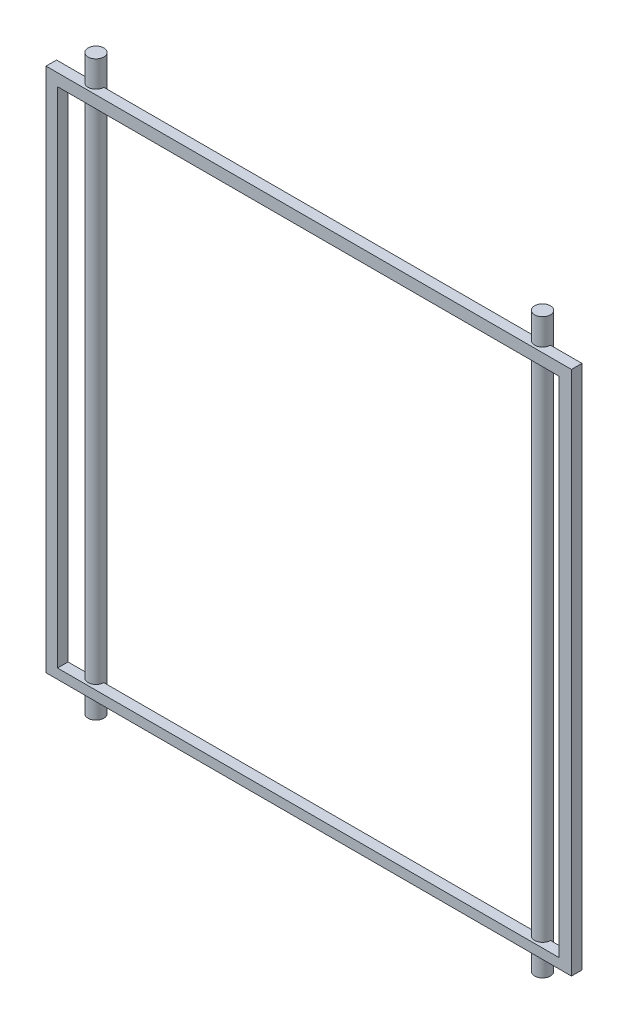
ISO-10303-21;
HEADER;
FILE_DESCRIPTION(('STEP AP214'),'2;1');
FILE_NAME('part.step','',(''),(''),'','','');
FILE_SCHEMA(('AUTOMOTIVE_DESIGN { 1 0 10303 214 1 1 1 1 }'));
ENDSEC;
DATA;
#1=APPLICATION_CONTEXT('core data for automotive mechanical design processes');
#2=APPLICATION_PROTOCOL_DEFINITION('international standard','automotive_design',2000,#1);
#3=PRODUCT_CONTEXT('',#1,'mechanical');
#4=PRODUCT('Part','Part','',(#3));
#5=PRODUCT_RELATED_PRODUCT_CATEGORY('part','',(#4));
#6=PRODUCT_DEFINITION_FORMATION('','',#4);
#7=PRODUCT_DEFINITION_CONTEXT('part definition',#1,'design');
#8=PRODUCT_DEFINITION('design','',#6,#7);
#9=PRODUCT_DEFINITION_SHAPE('','',#8);
#10=(LENGTH_UNIT() NAMED_UNIT(*) SI_UNIT(.MILLI.,.METRE.));
#11=(NAMED_UNIT(*) PLANE_ANGLE_UNIT() SI_UNIT($,.RADIAN.));
#12=(NAMED_UNIT(*) SI_UNIT($,.STERADIAN.) SOLID_ANGLE_UNIT());
#13=UNCERTAINTY_MEASURE_WITH_UNIT(LENGTH_MEASURE(1.E-05),#10,'distance_accuracy_value','');
#14=(GEOMETRIC_REPRESENTATION_CONTEXT(3) GLOBAL_UNCERTAINTY_ASSIGNED_CONTEXT((#13)) GLOBAL_UNIT_ASSIGNED_CONTEXT((#10,
#11,#12)) REPRESENTATION_CONTEXT('',''));
#15=CARTESIAN_POINT('',(0.,0.,0.));
#16=DIRECTION('',(0.,0.,1.));
#17=DIRECTION('',(1.,0.,0.));
#18=AXIS2_PLACEMENT_3D('',#15,#16,#17);
#19=CARTESIAN_POINT('',(-74.9999999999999,-80.,0.));
#20=DIRECTION('',(0.,0.,1.));
#21=DIRECTION('',(1.,0.,0.));
#22=AXIS2_PLACEMENT_3D('',#19,#20,#21);
#23=PLANE('',#22);
#24=DIRECTION('',(0.,-1.,0.));
#25=VECTOR('',#24,1.);
#26=CARTESIAN_POINT('',(-15.,970.000000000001,0.));
#27=LINE('',#26,#25);
#28=CARTESIAN_POINT('',(-15.,-80.0000000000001,0.));
#29=VERTEX_POINT('',#28);
#30=CARTESIAN_POINT('',(-15.,-61.2429061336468,0.));
#31=VERTEX_POINT('',#30);
#32=EDGE_CURVE('E47',#29,#31,#27,.F.);
#33=ORIENTED_EDGE('',*,*,#32,.F.);
#34=DIRECTION('',(1.,0.,0.));
#35=VECTOR('',#34,1.);
#36=CARTESIAN_POINT('',(-74.9999999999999,-80.,0.));
#37=LINE('',#36,#35);
#38=CARTESIAN_POINT('',(-74.9999999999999,-80.,0.));
#39=VERTEX_POINT('',#38);
#40=EDGE_CURVE('E243',#39,#29,#37,.T.);
#41=ORIENTED_EDGE('',*,*,#40,.F.);
#42=DIRECTION('',(0.,-1.,0.));
#43=VECTOR('',#42,1.);
#44=CARTESIAN_POINT('',(-75.,920.,0.));
#45=LINE('',#44,#43);
#46=CARTESIAN_POINT('',(-75.,920.,0.));
#47=VERTEX_POINT('',#46);
#48=EDGE_CURVE('E248',#47,#39,#45,.T.);
#49=ORIENTED_EDGE('',*,*,#48,.F.);
#50=DIRECTION('',(-1.,0.,0.));
#51=VECTOR('',#50,1.);
#52=CARTESIAN_POINT('',(-75.,920.,0.));
#53=LINE('',#52,#51);
#54=CARTESIAN_POINT('',(-15.,920.,0.));
#55=VERTEX_POINT('',#54);
#56=EDGE_CURVE('E156',#55,#47,#53,.T.);
#57=ORIENTED_EDGE('',*,*,#56,.F.);
#58=CARTESIAN_POINT('',(-15.,897.016941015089,0.));
#59=VERTEX_POINT('',#58);
#60=EDGE_CURVE('E144',#59,#55,#27,.F.);
#61=ORIENTED_EDGE('',*,*,#60,.F.);
#62=DIRECTION('',(-1.,0.,0.));
#63=VECTOR('',#62,1.);
#64=CARTESIAN_POINT('',(-53.1629825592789,897.016941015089,0.));
#65=LINE('',#64,#63);
#66=CARTESIAN_POINT('',(-53.1629825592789,897.016941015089,0.));
#67=VERTEX_POINT('',#66);
#68=EDGE_CURVE('E153',#59,#67,#65,.T.);
#69=ORIENTED_EDGE('',*,*,#68,.T.);
#70=DIRECTION('',(0.,-1.,0.));
#71=VECTOR('',#70,1.);
#72=CARTESIAN_POINT('',(-53.1629825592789,897.016941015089,0.));
#73=LINE('',#72,#71);
#74=CARTESIAN_POINT('',(-53.1629825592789,-61.2429061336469,0.));
#75=VERTEX_POINT('',#74);
#76=EDGE_CURVE('E192',#67,#75,#73,.T.);
#77=ORIENTED_EDGE('',*,*,#76,.T.);
#78=DIRECTION('',(1.,0.,0.));
#79=VECTOR('',#78,1.);
#80=CARTESIAN_POINT('',(-53.1629825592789,-61.2429061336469,0.));
#81=LINE('',#80,#79);
#82=EDGE_CURVE('E168',#75,#31,#81,.T.);
#83=ORIENTED_EDGE('',*,*,#82,.T.);
#84=EDGE_LOOP('',(#33,#41,#49,#57,#61,#69,#77,#83));
#85=FACE_BOUND('',#84,.T.);
#86=ADVANCED_FACE('F32',(#85),#23,.F.);
#87=DIRECTION('',(0.,-1.,0.));
#88=VECTOR('',#87,1.);
#89=CARTESIAN_POINT('',(15.,970.000000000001,0.));
#90=LINE('',#89,#88);
#91=CARTESIAN_POINT('',(15.,920.,0.));
#92=VERTEX_POINT('',#91);
#93=CARTESIAN_POINT('',(15.,897.016941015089,0.));
#94=VERTEX_POINT('',#93);
#95=EDGE_CURVE('E55',#92,#94,#90,.T.);
#96=ORIENTED_EDGE('',*,*,#95,.F.);
#97=CARTESIAN_POINT('',(834.999999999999,920.,0.));
#98=VERTEX_POINT('',#97);
#99=EDGE_CURVE('E240',#98,#92,#53,.T.);
#100=ORIENTED_EDGE('',*,*,#99,.F.);
#101=DIRECTION('',(0.,-1.,0.));
#102=VECTOR('',#101,1.);
#103=CARTESIAN_POINT('',(834.999999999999,970.000000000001,0.));
#104=LINE('',#103,#102);
#105=CARTESIAN_POINT('',(834.999999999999,897.016941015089,0.));
#106=VERTEX_POINT('',#105);
#107=EDGE_CURVE('E331',#106,#98,#104,.F.);
#108=ORIENTED_EDGE('',*,*,#107,.F.);
#109=EDGE_CURVE('E163',#106,#94,#65,.T.);
#110=ORIENTED_EDGE('',*,*,#109,.T.);
#111=EDGE_LOOP('',(#96,#100,#108,#110));
#112=FACE_BOUND('',#111,.T.);
#113=ADVANCED_FACE('F274',(#112),#23,.F.);
#114=CARTESIAN_POINT('',(15.,-61.2429061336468,0.));
#115=VERTEX_POINT('',#114);
#116=CARTESIAN_POINT('',(15.,-80.0000000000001,0.));
#117=VERTEX_POINT('',#116);
#118=EDGE_CURVE('E302',#115,#117,#90,.T.);
#119=ORIENTED_EDGE('',*,*,#118,.F.);
#120=CARTESIAN_POINT('',(834.999999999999,-61.2429061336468,0.));
#121=VERTEX_POINT('',#120);
#122=EDGE_CURVE('E196',#115,#121,#81,.T.);
#123=ORIENTED_EDGE('',*,*,#122,.T.);
#124=CARTESIAN_POINT('',(834.999999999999,-80.0000000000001,0.));
#125=VERTEX_POINT('',#124);
#126=EDGE_CURVE('E304',#125,#121,#104,.F.);
#127=ORIENTED_EDGE('',*,*,#126,.F.);
#128=EDGE_CURVE('E246',#117,#125,#37,.T.);
#129=ORIENTED_EDGE('',*,*,#128,.F.);
#130=EDGE_LOOP('',(#119,#123,#127,#129));
#131=FACE_BOUND('',#130,.T.);
#132=ADVANCED_FACE('F271',(#131),#23,.F.);
#133=CARTESIAN_POINT('',(-74.9999999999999,-80.,20.));
#134=DIRECTION('',(0.,1.,0.));
#135=DIRECTION('',(0.,0.,1.));
#136=AXIS2_PLACEMENT_3D('',#133,#134,#135);
#137=PLANE('',#136);
#138=CARTESIAN_POINT('',(0.,-80.0000000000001,0.));
#139=DIRECTION('',(0.,1.,0.));
#140=DIRECTION('',(0.,0.,1.));
#141=AXIS2_PLACEMENT_3D('',#138,#139,#140);
#142=CIRCLE('',#141,15.);
#143=EDGE_CURVE('E294',#117,#29,#142,.F.);
#144=ORIENTED_EDGE('',*,*,#143,.F.);
#145=ORIENTED_EDGE('',*,*,#128,.T.);
#146=CARTESIAN_POINT('',(850.,-80.0000000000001,0.));
#147=DIRECTION('',(0.,1.,0.));
#148=DIRECTION('',(0.,0.,1.));
#149=AXIS2_PLACEMENT_3D('',#146,#147,#148);
#150=CIRCLE('',#149,15.0000000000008);
#151=CARTESIAN_POINT('',(865.000000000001,-80.0000000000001,0.));
#152=VERTEX_POINT('',#151);
#153=EDGE_CURVE('E185',#152,#125,#150,.F.);
#154=ORIENTED_EDGE('',*,*,#153,.F.);
#155=CARTESIAN_POINT('',(925.,-80.,0.));
#156=VERTEX_POINT('',#155);
#157=EDGE_CURVE('E247',#152,#156,#37,.T.);
#158=ORIENTED_EDGE('',*,*,#157,.T.);
#159=DIRECTION('',(0.,0.,-1.));
#160=VECTOR('',#159,1.);
#161=CARTESIAN_POINT('',(925.,-80.,20.));
#162=LINE('',#161,#160);
#163=CARTESIAN_POINT('',(925.,-80.,20.));
#164=VERTEX_POINT('',#163);
#165=EDGE_CURVE('E224',#164,#156,#162,.T.);
#166=ORIENTED_EDGE('',*,*,#165,.F.);
#167=DIRECTION('',(1.,0.,0.));
#168=VECTOR('',#167,1.);
#169=CARTESIAN_POINT('',(-74.9999999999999,-80.,20.));
#170=LINE('',#169,#168);
#171=CARTESIAN_POINT('',(-74.9999999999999,-80.,20.));
#172=VERTEX_POINT('',#171);
#173=EDGE_CURVE('E254',#172,#164,#170,.T.);
#174=ORIENTED_EDGE('',*,*,#173,.F.);
#175=DIRECTION('',(0.,0.,-1.));
#176=VECTOR('',#175,1.);
#177=CARTESIAN_POINT('',(-74.9999999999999,-80.,20.));
#178=LINE('',#177,#176);
#179=EDGE_CURVE('E222',#172,#39,#178,.T.);
#180=ORIENTED_EDGE('',*,*,#179,.T.);
#181=ORIENTED_EDGE('',*,*,#40,.T.);
#182=EDGE_LOOP('',(#144,#145,#154,#158,#166,#174,#180,#181));
#183=FACE_BOUND('',#182,.T.);
#184=ADVANCED_FACE('F283',(#183),#137,.F.);
#185=CARTESIAN_POINT('',(-75.,920.,20.));
#186=DIRECTION('',(0.,-1.,0.));
#187=DIRECTION('',(0.,0.,-1.));
#188=AXIS2_PLACEMENT_3D('',#185,#186,#187);
#189=PLANE('',#188);
#190=CARTESIAN_POINT('',(0.,920.,0.));
#191=DIRECTION('',(0.,-1.,0.));
#192=DIRECTION('',(0.,0.,-1.));
#193=AXIS2_PLACEMENT_3D('',#190,#191,#192);
#194=CIRCLE('',#193,15.);
#195=EDGE_CURVE('E157',#55,#92,#194,.F.);
#196=ORIENTED_EDGE('',*,*,#195,.F.);
#197=ORIENTED_EDGE('',*,*,#56,.T.);
#198=DIRECTION('',(0.,0.,-1.));
#199=VECTOR('',#198,1.);
#200=CARTESIAN_POINT('',(-75.,920.,20.));
#201=LINE('',#200,#199);
#202=CARTESIAN_POINT('',(-75.,920.,20.));
#203=VERTEX_POINT('',#202);
#204=EDGE_CURVE('E232',#203,#47,#201,.T.);
#205=ORIENTED_EDGE('',*,*,#204,.F.);
#206=DIRECTION('',(-1.,0.,0.));
#207=VECTOR('',#206,1.);
#208=CARTESIAN_POINT('',(-75.,920.,20.));
#209=LINE('',#208,#207);
#210=CARTESIAN_POINT('',(925.,920.,20.));
#211=VERTEX_POINT('',#210);
#212=EDGE_CURVE('E235',#211,#203,#209,.T.);
#213=ORIENTED_EDGE('',*,*,#212,.F.);
#214=DIRECTION('',(0.,0.,-1.));
#215=VECTOR('',#214,1.);
#216=CARTESIAN_POINT('',(925.,920.,20.));
#217=LINE('',#216,#215);
#218=CARTESIAN_POINT('',(925.,920.,0.));
#219=VERTEX_POINT('',#218);
#220=EDGE_CURVE('E229',#211,#219,#217,.T.);
#221=ORIENTED_EDGE('',*,*,#220,.T.);
#222=CARTESIAN_POINT('',(865.000000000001,920.,0.));
#223=VERTEX_POINT('',#222);
#224=EDGE_CURVE('E236',#219,#223,#53,.T.);
#225=ORIENTED_EDGE('',*,*,#224,.T.);
#226=CARTESIAN_POINT('',(850.,920.,0.));
#227=DIRECTION('',(0.,-1.,0.));
#228=DIRECTION('',(0.,0.,-1.));
#229=AXIS2_PLACEMENT_3D('',#226,#227,#228);
#230=CIRCLE('',#229,15.0000000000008);
#231=EDGE_CURVE('E313',#98,#223,#230,.F.);
#232=ORIENTED_EDGE('',*,*,#231,.F.);
#233=ORIENTED_EDGE('',*,*,#99,.T.);
#234=EDGE_LOOP('',(#196,#197,#205,#213,#221,#225,#232,#233));
#235=FACE_BOUND('',#234,.T.);
#236=ADVANCED_FACE('F280',(#235),#189,.F.);
#237=CARTESIAN_POINT('',(-53.1629825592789,-61.2429061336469,20.));
#238=DIRECTION('',(0.,1.,0.));
#239=DIRECTION('',(0.,0.,1.));
#240=AXIS2_PLACEMENT_3D('',#237,#238,#239);
#241=PLANE('',#240);
#242=ORIENTED_EDGE('',*,*,#122,.F.);
#243=CARTESIAN_POINT('',(0.,-61.2429061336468,0.));
#244=DIRECTION('',(0.,1.,0.));
#245=DIRECTION('',(0.,0.,1.));
#246=AXIS2_PLACEMENT_3D('',#243,#244,#245);
#247=CIRCLE('',#246,15.);
#248=EDGE_CURVE('E319',#115,#31,#247,.F.);
#249=ORIENTED_EDGE('',*,*,#248,.T.);
#250=ORIENTED_EDGE('',*,*,#82,.F.);
#251=DIRECTION('',(0.,0.,-1.));
#252=VECTOR('',#251,1.);
#253=CARTESIAN_POINT('',(-53.1629825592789,-61.2429061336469,20.));
#254=LINE('',#253,#252);
#255=CARTESIAN_POINT('',(-53.1629825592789,-61.2429061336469,20.));
#256=VERTEX_POINT('',#255);
#257=EDGE_CURVE('E213',#256,#75,#254,.T.);
#258=ORIENTED_EDGE('',*,*,#257,.F.);
#259=DIRECTION('',(1.,0.,0.));
#260=VECTOR('',#259,1.);
#261=CARTESIAN_POINT('',(-53.1629825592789,-61.2429061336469,20.));
#262=LINE('',#261,#260);
#263=CARTESIAN_POINT('',(901.177601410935,-61.2429061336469,20.));
#264=VERTEX_POINT('',#263);
#265=EDGE_CURVE('E176',#256,#264,#262,.T.);
#266=ORIENTED_EDGE('',*,*,#265,.T.);
#267=DIRECTION('',(0.,0.,-1.));
#268=VECTOR('',#267,1.);
#269=CARTESIAN_POINT('',(901.177601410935,-61.2429061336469,20.));
#270=LINE('',#269,#268);
#271=CARTESIAN_POINT('',(901.177601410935,-61.2429061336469,0.));
#272=VERTEX_POINT('',#271);
#273=EDGE_CURVE('E207',#264,#272,#270,.T.);
#274=ORIENTED_EDGE('',*,*,#273,.T.);
#275=CARTESIAN_POINT('',(865.000000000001,-61.2429061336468,0.));
#276=VERTEX_POINT('',#275);
#277=EDGE_CURVE('E194',#276,#272,#81,.T.);
#278=ORIENTED_EDGE('',*,*,#277,.F.);
#279=CARTESIAN_POINT('',(850.,-61.2429061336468,0.));
#280=DIRECTION('',(0.,1.,0.));
#281=DIRECTION('',(0.,0.,1.));
#282=AXIS2_PLACEMENT_3D('',#279,#280,#281);
#283=CIRCLE('',#282,15.0000000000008);
#284=EDGE_CURVE('E333',#276,#121,#283,.F.);
#285=ORIENTED_EDGE('',*,*,#284,.T.);
#286=EDGE_LOOP('',(#242,#249,#250,#258,#266,#274,#278,#285));
#287=FACE_BOUND('',#286,.T.);
#288=ADVANCED_FACE('F209',(#287),#241,.T.);
#289=CARTESIAN_POINT('',(-53.1629825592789,897.016941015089,20.));
#290=DIRECTION('',(0.,-1.,0.));
#291=DIRECTION('',(0.,0.,-1.));
#292=AXIS2_PLACEMENT_3D('',#289,#290,#291);
#293=PLANE('',#292);
#294=ORIENTED_EDGE('',*,*,#68,.F.);
#295=CARTESIAN_POINT('',(0.,897.016941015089,0.));
#296=DIRECTION('',(0.,-1.,0.));
#297=DIRECTION('',(0.,0.,-1.));
#298=AXIS2_PLACEMENT_3D('',#295,#296,#297);
#299=CIRCLE('',#298,15.);
#300=EDGE_CURVE('E11',#59,#94,#299,.F.);
#301=ORIENTED_EDGE('',*,*,#300,.T.);
#302=ORIENTED_EDGE('',*,*,#109,.F.);
#303=CARTESIAN_POINT('',(850.,897.016941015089,0.));
#304=DIRECTION('',(0.,-1.,0.));
#305=DIRECTION('',(0.,0.,-1.));
#306=AXIS2_PLACEMENT_3D('',#303,#304,#305);
#307=CIRCLE('',#306,15.0000000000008);
#308=CARTESIAN_POINT('',(865.000000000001,897.016941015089,0.));
#309=VERTEX_POINT('',#308);
#310=EDGE_CURVE('E40',#106,#309,#307,.F.);
#311=ORIENTED_EDGE('',*,*,#310,.T.);
#312=CARTESIAN_POINT('',(901.177601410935,897.016941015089,0.));
#313=VERTEX_POINT('',#312);
#314=EDGE_CURVE('E166',#313,#309,#65,.T.);
#315=ORIENTED_EDGE('',*,*,#314,.F.);
#316=DIRECTION('',(0.,0.,-1.));
#317=VECTOR('',#316,1.);
#318=CARTESIAN_POINT('',(901.177601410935,897.016941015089,20.));
#319=LINE('',#318,#317);
#320=CARTESIAN_POINT('',(901.177601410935,897.016941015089,20.));
#321=VERTEX_POINT('',#320);
#322=EDGE_CURVE('E214',#321,#313,#319,.T.);
#323=ORIENTED_EDGE('',*,*,#322,.F.);
#324=DIRECTION('',(-1.,0.,0.));
#325=VECTOR('',#324,1.);
#326=CARTESIAN_POINT('',(-53.1629825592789,897.016941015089,20.));
#327=LINE('',#326,#325);
#328=CARTESIAN_POINT('',(-53.1629825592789,897.016941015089,20.));
#329=VERTEX_POINT('',#328);
#330=EDGE_CURVE('E190',#321,#329,#327,.T.);
#331=ORIENTED_EDGE('',*,*,#330,.T.);
#332=DIRECTION('',(0.,0.,-1.));
#333=VECTOR('',#332,1.);
#334=CARTESIAN_POINT('',(-53.1629825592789,897.016941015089,20.));
#335=LINE('',#334,#333);
#336=EDGE_CURVE('E162',#329,#67,#335,.T.);
#337=ORIENTED_EDGE('',*,*,#336,.T.);
#338=EDGE_LOOP('',(#294,#301,#302,#311,#315,#323,#331,#337));
#339=FACE_BOUND('',#338,.T.);
#340=ADVANCED_FACE('F160',(#339),#293,.T.);
#341=DIRECTION('',(0.,-1.,0.));
#342=VECTOR('',#341,1.);
#343=CARTESIAN_POINT('',(865.000000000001,970.000000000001,0.));
#344=LINE('',#343,#342);
#345=EDGE_CURVE('E310',#223,#309,#344,.T.);
#346=ORIENTED_EDGE('',*,*,#345,.F.);
#347=ORIENTED_EDGE('',*,*,#224,.F.);
#348=DIRECTION('',(0.,1.,0.));
#349=VECTOR('',#348,1.);
#350=CARTESIAN_POINT('',(925.,920.,0.));
#351=LINE('',#350,#349);
#352=EDGE_CURVE('E241',#156,#219,#351,.T.);
#353=ORIENTED_EDGE('',*,*,#352,.F.);
#354=ORIENTED_EDGE('',*,*,#157,.F.);
#355=EDGE_CURVE('E203',#276,#152,#344,.T.);
#356=ORIENTED_EDGE('',*,*,#355,.F.);
#357=ORIENTED_EDGE('',*,*,#277,.T.);
#358=DIRECTION('',(0.,1.,0.));
#359=VECTOR('',#358,1.);
#360=CARTESIAN_POINT('',(901.177601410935,897.016941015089,0.));
#361=LINE('',#360,#359);
#362=EDGE_CURVE('E164',#272,#313,#361,.T.);
#363=ORIENTED_EDGE('',*,*,#362,.T.);
#364=ORIENTED_EDGE('',*,*,#314,.T.);
#365=EDGE_LOOP('',(#346,#347,#353,#354,#356,#357,#363,#364));
#366=FACE_BOUND('',#365,.T.);
#367=ADVANCED_FACE('F200',(#366),#23,.F.);
#368=CARTESIAN_POINT('',(-74.9999999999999,-80.,20.));
#369=DIRECTION('',(0.,0.,1.));
#370=DIRECTION('',(1.,0.,0.));
#371=AXIS2_PLACEMENT_3D('',#368,#369,#370);
#372=PLANE('',#371);
#373=DIRECTION('',(0.,-1.,0.));
#374=VECTOR('',#373,1.);
#375=CARTESIAN_POINT('',(-75.,920.,20.));
#376=LINE('',#375,#374);
#377=EDGE_CURVE('E239',#203,#172,#376,.T.);
#378=ORIENTED_EDGE('',*,*,#377,.T.);
#379=ORIENTED_EDGE('',*,*,#173,.T.);
#380=DIRECTION('',(0.,1.,0.));
#381=VECTOR('',#380,1.);
#382=CARTESIAN_POINT('',(925.,920.,20.));
#383=LINE('',#382,#381);
#384=EDGE_CURVE('E252',#164,#211,#383,.T.);
#385=ORIENTED_EDGE('',*,*,#384,.T.);
#386=ORIENTED_EDGE('',*,*,#212,.T.);
#387=EDGE_LOOP('',(#378,#379,#385,#386));
#388=FACE_BOUND('',#387,.T.);
#389=ORIENTED_EDGE('',*,*,#265,.F.);
#390=DIRECTION('',(0.,-1.,0.));
#391=VECTOR('',#390,1.);
#392=CARTESIAN_POINT('',(-53.1629825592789,897.016941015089,20.));
#393=LINE('',#392,#391);
#394=EDGE_CURVE('E172',#329,#256,#393,.T.);
#395=ORIENTED_EDGE('',*,*,#394,.F.);
#396=ORIENTED_EDGE('',*,*,#330,.F.);
#397=DIRECTION('',(0.,1.,0.));
#398=VECTOR('',#397,1.);
#399=CARTESIAN_POINT('',(901.177601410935,897.016941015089,20.));
#400=LINE('',#399,#398);
#401=EDGE_CURVE('E182',#264,#321,#400,.T.);
#402=ORIENTED_EDGE('',*,*,#401,.F.);
#403=EDGE_LOOP('',(#389,#395,#396,#402));
#404=FACE_BOUND('',#403,.T.);
#405=ADVANCED_FACE('F260',(#388,#404),#372,.T.);
#406=CARTESIAN_POINT('',(-75.,920.,20.));
#407=DIRECTION('',(1.,0.,0.));
#408=DIRECTION('',(0.,1.,0.));
#409=AXIS2_PLACEMENT_3D('',#406,#407,#408);
#410=PLANE('',#409);
#411=ORIENTED_EDGE('',*,*,#48,.T.);
#412=ORIENTED_EDGE('',*,*,#179,.F.);
#413=ORIENTED_EDGE('',*,*,#377,.F.);
#414=ORIENTED_EDGE('',*,*,#204,.T.);
#415=EDGE_LOOP('',(#411,#412,#413,#414));
#416=FACE_BOUND('',#415,.T.);
#417=ADVANCED_FACE('F34',(#416),#410,.F.);
#418=CARTESIAN_POINT('',(925.,920.,20.));
#419=DIRECTION('',(-1.,0.,0.));
#420=DIRECTION('',(0.,0.,1.));
#421=AXIS2_PLACEMENT_3D('',#418,#419,#420);
#422=PLANE('',#421);
#423=ORIENTED_EDGE('',*,*,#352,.T.);
#424=ORIENTED_EDGE('',*,*,#220,.F.);
#425=ORIENTED_EDGE('',*,*,#384,.F.);
#426=ORIENTED_EDGE('',*,*,#165,.T.);
#427=EDGE_LOOP('',(#423,#424,#425,#426));
#428=FACE_BOUND('',#427,.T.);
#429=ADVANCED_FACE('F268',(#428),#422,.F.);
#430=CARTESIAN_POINT('',(-53.1629825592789,897.016941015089,20.));
#431=DIRECTION('',(1.,0.,0.));
#432=DIRECTION('',(0.,0.,-1.));
#433=AXIS2_PLACEMENT_3D('',#430,#431,#432);
#434=PLANE('',#433);
#435=ORIENTED_EDGE('',*,*,#76,.F.);
#436=ORIENTED_EDGE('',*,*,#336,.F.);
#437=ORIENTED_EDGE('',*,*,#394,.T.);
#438=ORIENTED_EDGE('',*,*,#257,.T.);
#439=EDGE_LOOP('',(#435,#436,#437,#438));
#440=FACE_BOUND('',#439,.T.);
#441=ADVANCED_FACE('F258',(#440),#434,.T.);
#442=CARTESIAN_POINT('',(901.177601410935,897.016941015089,20.));
#443=DIRECTION('',(-1.,0.,0.));
#444=DIRECTION('',(0.,0.,1.));
#445=AXIS2_PLACEMENT_3D('',#442,#443,#444);
#446=PLANE('',#445);
#447=ORIENTED_EDGE('',*,*,#362,.F.);
#448=ORIENTED_EDGE('',*,*,#273,.F.);
#449=ORIENTED_EDGE('',*,*,#401,.T.);
#450=ORIENTED_EDGE('',*,*,#322,.T.);
#451=EDGE_LOOP('',(#447,#448,#449,#450));
#452=FACE_BOUND('',#451,.T.);
#453=ADVANCED_FACE('F216',(#452),#446,.T.);
#454=CARTESIAN_POINT('',(850.,970.000000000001,0.));
#455=DIRECTION('',(0.,-1.,0.));
#456=DIRECTION('',(0.,0.,-1.));
#457=AXIS2_PLACEMENT_3D('',#454,#455,#456);
#458=CYLINDRICAL_SURFACE('',#457,15.0000000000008);
#459=ORIENTED_EDGE('',*,*,#107,.T.);
#460=ORIENTED_EDGE('',*,*,#231,.T.);
#461=ORIENTED_EDGE('',*,*,#345,.T.);
#462=ORIENTED_EDGE('',*,*,#310,.F.);
#463=EDGE_LOOP('',(#459,#460,#461,#462));
#464=FACE_BOUND('',#463,.T.);
#465=CARTESIAN_POINT('',(850.,970.000000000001,0.));
#466=DIRECTION('',(0.,1.,0.));
#467=DIRECTION('',(0.,0.,1.));
#468=AXIS2_PLACEMENT_3D('',#465,#466,#467);
#469=CIRCLE('',#468,15.0000000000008);
#470=CARTESIAN_POINT('',(850.,970.000000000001,15.0000000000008));
#471=VERTEX_POINT('',#470);
#472=EDGE_CURVE('E327',#471,#471,#469,.T.);
#473=ORIENTED_EDGE('',*,*,#472,.F.);
#474=EDGE_LOOP('',(#473));
#475=FACE_BOUND('',#474,.T.);
#476=CARTESIAN_POINT('',(850.,-120.,0.));
#477=DIRECTION('',(0.,1.,0.));
#478=DIRECTION('',(0.,0.,1.));
#479=AXIS2_PLACEMENT_3D('',#476,#477,#478);
#480=CIRCLE('',#479,15.0000000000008);
#481=CARTESIAN_POINT('',(850.,-120.,15.0000000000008));
#482=VERTEX_POINT('',#481);
#483=EDGE_CURVE('E298',#482,#482,#480,.T.);
#484=ORIENTED_EDGE('',*,*,#483,.T.);
#485=EDGE_LOOP('',(#484));
#486=FACE_BOUND('',#485,.T.);
#487=ORIENTED_EDGE('',*,*,#355,.T.);
#488=ORIENTED_EDGE('',*,*,#153,.T.);
#489=ORIENTED_EDGE('',*,*,#126,.T.);
#490=ORIENTED_EDGE('',*,*,#284,.F.);
#491=EDGE_LOOP('',(#487,#488,#489,#490));
#492=FACE_BOUND('',#491,.T.);
#493=ADVANCED_FACE('F335',(#464,#475,#486,#492),#458,.T.);
#494=CARTESIAN_POINT('',(850.,970.000000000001,0.));
#495=DIRECTION('',(0.,1.,0.));
#496=DIRECTION('',(0.,0.,1.));
#497=AXIS2_PLACEMENT_3D('',#494,#495,#496);
#498=PLANE('',#497);
#499=ORIENTED_EDGE('',*,*,#472,.T.);
#500=EDGE_LOOP('',(#499));
#501=FACE_BOUND('',#500,.T.);
#502=ADVANCED_FACE('F337',(#501),#498,.T.);
#503=CARTESIAN_POINT('',(850.,-120.,0.));
#504=DIRECTION('',(0.,1.,0.));
#505=DIRECTION('',(0.,0.,1.));
#506=AXIS2_PLACEMENT_3D('',#503,#504,#505);
#507=PLANE('',#506);
#508=ORIENTED_EDGE('',*,*,#483,.F.);
#509=EDGE_LOOP('',(#508));
#510=FACE_BOUND('',#509,.T.);
#511=ADVANCED_FACE('F343',(#510),#507,.F.);
#512=CARTESIAN_POINT('',(0.,970.000000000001,0.));
#513=DIRECTION('',(0.,-1.,0.));
#514=DIRECTION('',(0.,0.,-1.));
#515=AXIS2_PLACEMENT_3D('',#512,#513,#514);
#516=CYLINDRICAL_SURFACE('',#515,15.);
#517=ORIENTED_EDGE('',*,*,#60,.T.);
#518=ORIENTED_EDGE('',*,*,#195,.T.);
#519=ORIENTED_EDGE('',*,*,#95,.T.);
#520=ORIENTED_EDGE('',*,*,#300,.F.);
#521=EDGE_LOOP('',(#517,#518,#519,#520));
#522=FACE_BOUND('',#521,.T.);
#523=CARTESIAN_POINT('',(0.,970.000000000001,0.));
#524=DIRECTION('',(0.,1.,0.));
#525=DIRECTION('',(0.,0.,1.));
#526=AXIS2_PLACEMENT_3D('',#523,#524,#525);
#527=CIRCLE('',#526,15.);
#528=CARTESIAN_POINT('',(0.,970.000000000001,15.));
#529=VERTEX_POINT('',#528);
#530=EDGE_CURVE('E460',#529,#529,#527,.T.);
#531=ORIENTED_EDGE('',*,*,#530,.F.);
#532=EDGE_LOOP('',(#531));
#533=FACE_BOUND('',#532,.T.);
#534=CARTESIAN_POINT('',(0.,-120.,0.));
#535=DIRECTION('',(0.,1.,0.));
#536=DIRECTION('',(0.,0.,1.));
#537=AXIS2_PLACEMENT_3D('',#534,#535,#536);
#538=CIRCLE('',#537,15.);
#539=CARTESIAN_POINT('',(0.,-120.,15.));
#540=VERTEX_POINT('',#539);
#541=EDGE_CURVE('E458',#540,#540,#538,.T.);
#542=ORIENTED_EDGE('',*,*,#541,.T.);
#543=EDGE_LOOP('',(#542));
#544=FACE_BOUND('',#543,.T.);
#545=ORIENTED_EDGE('',*,*,#118,.T.);
#546=ORIENTED_EDGE('',*,*,#143,.T.);
#547=ORIENTED_EDGE('',*,*,#32,.T.);
#548=ORIENTED_EDGE('',*,*,#248,.F.);
#549=EDGE_LOOP('',(#545,#546,#547,#548));
#550=FACE_BOUND('',#549,.T.);
#551=ADVANCED_FACE('F142',(#522,#533,#544,#550),#516,.T.);
#552=CARTESIAN_POINT('',(0.,970.000000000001,0.));
#553=DIRECTION('',(0.,1.,0.));
#554=DIRECTION('',(0.,0.,1.));
#555=AXIS2_PLACEMENT_3D('',#552,#553,#554);
#556=PLANE('',#555);
#557=ORIENTED_EDGE('',*,*,#530,.T.);
#558=EDGE_LOOP('',(#557));
#559=FACE_BOUND('',#558,.T.);
#560=ADVANCED_FACE('F433',(#559),#556,.T.);
#561=CARTESIAN_POINT('',(0.,-120.,0.));
#562=DIRECTION('',(0.,1.,0.));
#563=DIRECTION('',(0.,0.,1.));
#564=AXIS2_PLACEMENT_3D('',#561,#562,#563);
#565=PLANE('',#564);
#566=ORIENTED_EDGE('',*,*,#541,.F.);
#567=EDGE_LOOP('',(#566));
#568=FACE_BOUND('',#567,.T.);
#569=ADVANCED_FACE('F442',(#568),#565,.F.);
#570=CLOSED_SHELL('',(#86,#113,#132,#184,#236,#288,#340,#367,#405,#417,#429,#441,#453,#493,#502,
#511,#551,#560,#569));
#571=MANIFOLD_SOLID_BREP('B2',#570);
#572=ADVANCED_BREP_SHAPE_REPRESENTATION('',(#18,#571),#14);
#573=SHAPE_DEFINITION_REPRESENTATION(#9,#572);
ENDSEC;
END-ISO-10303-21;
